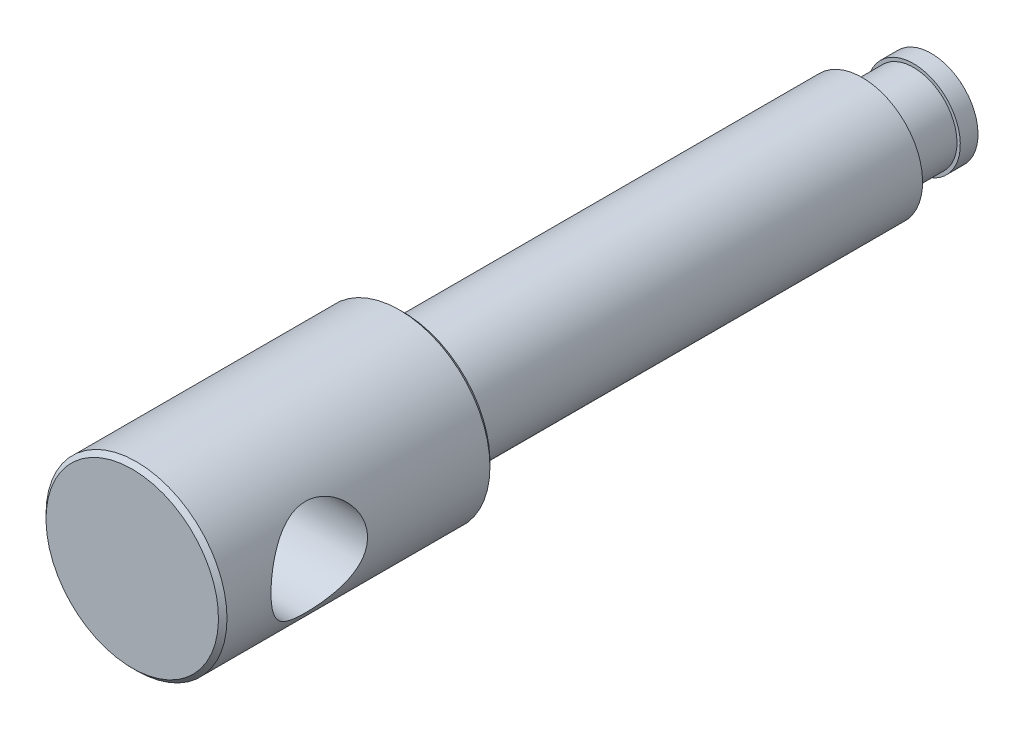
ISO-10303-21;
HEADER;
FILE_DESCRIPTION(('STEP AP214'),'2;1');
FILE_NAME('part.step','',(''),(''),'','','');
FILE_SCHEMA(('AUTOMOTIVE_DESIGN { 1 0 10303 214 1 1 1 1 }'));
ENDSEC;
DATA;
#1=APPLICATION_CONTEXT('core data for automotive mechanical design processes');
#2=APPLICATION_PROTOCOL_DEFINITION('international standard','automotive_design',2000,#1);
#3=PRODUCT_CONTEXT('',#1,'mechanical');
#4=PRODUCT('Part','Part','',(#3));
#5=PRODUCT_RELATED_PRODUCT_CATEGORY('part','',(#4));
#6=PRODUCT_DEFINITION_FORMATION('','',#4);
#7=PRODUCT_DEFINITION_CONTEXT('part definition',#1,'design');
#8=PRODUCT_DEFINITION('design','',#6,#7);
#9=PRODUCT_DEFINITION_SHAPE('','',#8);
#10=(LENGTH_UNIT() NAMED_UNIT(*) SI_UNIT(.MILLI.,.METRE.));
#11=(NAMED_UNIT(*) PLANE_ANGLE_UNIT() SI_UNIT($,.RADIAN.));
#12=(NAMED_UNIT(*) SI_UNIT($,.STERADIAN.) SOLID_ANGLE_UNIT());
#13=UNCERTAINTY_MEASURE_WITH_UNIT(LENGTH_MEASURE(1.E-05),#10,'distance_accuracy_value','');
#14=(GEOMETRIC_REPRESENTATION_CONTEXT(3) GLOBAL_UNCERTAINTY_ASSIGNED_CONTEXT((#13)) GLOBAL_UNIT_ASSIGNED_CONTEXT((#10,
#11,#12)) REPRESENTATION_CONTEXT('',''));
#15=CARTESIAN_POINT('',(0.,0.,0.));
#16=DIRECTION('',(0.,0.,1.));
#17=DIRECTION('',(1.,0.,0.));
#18=AXIS2_PLACEMENT_3D('',#15,#16,#17);
#19=CARTESIAN_POINT('',(0.,0.,13.));
#20=DIRECTION('',(-1.,0.,0.));
#21=DIRECTION('',(0.,1.,0.));
#22=AXIS2_PLACEMENT_3D('',#19,#20,#21);
#23=SPHERICAL_SURFACE('',#22,13.);
#24=CARTESIAN_POINT('',(0.,0.,2.56268712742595));
#25=DIRECTION('',(0.,0.,1.));
#26=DIRECTION('',(0.,-1.,0.));
#27=AXIS2_PLACEMENT_3D('',#24,#25,#26);
#28=CIRCLE('',#27,7.75);
#29=CARTESIAN_POINT('',(0.,-7.75,2.56268712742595));
#30=VERTEX_POINT('',#29);
#31=EDGE_CURVE('E130',#30,#30,#28,.T.);
#32=ORIENTED_EDGE('',*,*,#31,.F.);
#33=EDGE_LOOP('',(#32));
#34=FACE_BOUND('',#33,.T.);
#35=ADVANCED_FACE('F12',(#34),#23,.T.);
#36=CARTESIAN_POINT('',(0.,0.,135.));
#37=DIRECTION('',(0.,0.,-1.));
#38=DIRECTION('',(0.,1.,0.));
#39=AXIS2_PLACEMENT_3D('',#36,#37,#38);
#40=PLANE('',#39);
#41=CARTESIAN_POINT('',(0.,0.,135.));
#42=DIRECTION('',(0.,0.,-1.));
#43=DIRECTION('',(0.,1.,0.));
#44=AXIS2_PLACEMENT_3D('',#41,#42,#43);
#45=CIRCLE('',#44,14.2928932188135);
#46=CARTESIAN_POINT('',(0.,14.2928932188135,135.));
#47=VERTEX_POINT('',#46);
#48=EDGE_CURVE('E96',#47,#47,#45,.T.);
#49=ORIENTED_EDGE('',*,*,#48,.F.);
#50=EDGE_LOOP('',(#49));
#51=FACE_BOUND('',#50,.T.);
#52=ADVANCED_FACE('F103',(#51),#40,.F.);
#53=CARTESIAN_POINT('',(0.,0.,0.));
#54=DIRECTION('',(0.,0.,1.));
#55=DIRECTION('',(0.,-1.,0.));
#56=AXIS2_PLACEMENT_3D('',#53,#54,#55);
#57=CYLINDRICAL_SURFACE('',#56,7.75);
#58=CARTESIAN_POINT('',(0.,0.,5.5));
#59=DIRECTION('',(0.,0.,1.));
#60=DIRECTION('',(0.,-1.,0.));
#61=AXIS2_PLACEMENT_3D('',#58,#59,#60);
#62=CIRCLE('',#61,7.75);
#63=CARTESIAN_POINT('',(0.,-7.75,5.5));
#64=VERTEX_POINT('',#63);
#65=EDGE_CURVE('E133',#64,#64,#62,.F.);
#66=ORIENTED_EDGE('',*,*,#65,.T.);
#67=EDGE_LOOP('',(#66));
#68=FACE_BOUND('',#67,.T.);
#69=ORIENTED_EDGE('',*,*,#31,.T.);
#70=EDGE_LOOP('',(#69));
#71=FACE_BOUND('',#70,.T.);
#72=ADVANCED_FACE('F107',(#68,#71),#57,.T.);
#73=CARTESIAN_POINT('',(0.,0.,134.292893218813));
#74=DIRECTION('',(0.,0.,-1.));
#75=DIRECTION('',(0.,1.,0.));
#76=AXIS2_PLACEMENT_3D('',#73,#74,#75);
#77=CONICAL_SURFACE('',#76,15.0000000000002,0.785398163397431);
#78=ORIENTED_EDGE('',*,*,#48,.T.);
#79=EDGE_LOOP('',(#78));
#80=FACE_BOUND('',#79,.T.);
#81=CARTESIAN_POINT('',(0.,0.,134.292893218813));
#82=DIRECTION('',(0.,0.,1.));
#83=DIRECTION('',(0.,-1.,0.));
#84=AXIS2_PLACEMENT_3D('',#81,#82,#83);
#85=CIRCLE('',#84,15.);
#86=CARTESIAN_POINT('',(0.,-15.,134.292893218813));
#87=VERTEX_POINT('',#86);
#88=EDGE_CURVE('E93',#87,#87,#85,.F.);
#89=ORIENTED_EDGE('',*,*,#88,.F.);
#90=EDGE_LOOP('',(#89));
#91=FACE_BOUND('',#90,.T.);
#92=ADVANCED_FACE('F110',(#80,#91),#77,.T.);
#93=CARTESIAN_POINT('',(7.2,0.,5.5));
#94=DIRECTION('',(0.,0.,-1.));
#95=DIRECTION('',(0.,1.,0.));
#96=AXIS2_PLACEMENT_3D('',#93,#94,#95);
#97=PLANE('',#96);
#98=CARTESIAN_POINT('',(0.,0.,5.5));
#99=DIRECTION('',(0.,0.,1.));
#100=DIRECTION('',(0.,-1.,0.));
#101=AXIS2_PLACEMENT_3D('',#98,#99,#100);
#102=CIRCLE('',#101,7.2);
#103=CARTESIAN_POINT('',(0.,-7.2,5.5));
#104=VERTEX_POINT('',#103);
#105=EDGE_CURVE('E90',#104,#104,#102,.T.);
#106=ORIENTED_EDGE('',*,*,#105,.F.);
#107=EDGE_LOOP('',(#106));
#108=FACE_BOUND('',#107,.T.);
#109=ORIENTED_EDGE('',*,*,#65,.F.);
#110=EDGE_LOOP('',(#109));
#111=FACE_BOUND('',#110,.T.);
#112=ADVANCED_FACE('F44',(#108,#111),#97,.F.);
#113=CARTESIAN_POINT('',(0.,0.,0.));
#114=DIRECTION('',(0.,0.,1.));
#115=DIRECTION('',(0.,-1.,0.));
#116=AXIS2_PLACEMENT_3D('',#113,#114,#115);
#117=CYLINDRICAL_SURFACE('',#116,15.);
#118=CARTESIAN_POINT('',(-12.6885775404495,8.,119.));
#119=CARTESIAN_POINT('',(-12.6885765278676,8.00000082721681,118.793719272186));
#120=CARTESIAN_POINT('',(-12.6936244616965,7.99201174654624,118.587447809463));
#121=CARTESIAN_POINT('',(-12.7136132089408,7.96017537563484,118.176540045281));
#122=CARTESIAN_POINT('',(-12.728557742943,7.93632212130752,117.97190438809));
#123=CARTESIAN_POINT('',(-12.7677833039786,7.87306095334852,117.565697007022));
#124=CARTESIAN_POINT('',(-12.7920765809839,7.83363262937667,117.364129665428));
#125=CARTESIAN_POINT('',(-12.8491080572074,7.73973085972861,116.965672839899));
#126=CARTESIAN_POINT('',(-12.8818499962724,7.68525075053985,116.768785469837));
#127=CARTESIAN_POINT('',(-12.9544169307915,7.56228385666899,116.382225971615));
#128=CARTESIAN_POINT('',(-12.9941952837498,7.49388888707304,116.192515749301));
#129=CARTESIAN_POINT('',(-13.0797616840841,7.34352220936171,115.81989442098));
#130=CARTESIAN_POINT('',(-13.125551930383,7.26154553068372,115.636985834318));
#131=CARTESIAN_POINT('',(-13.2218490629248,7.08468954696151,115.278838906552));
#132=CARTESIAN_POINT('',(-13.2723552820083,6.98981206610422,115.103599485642));
#133=CARTESIAN_POINT('',(-13.3767912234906,6.78781438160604,114.761475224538));
#134=CARTESIAN_POINT('',(-13.4307210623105,6.68069376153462,114.594590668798));
#135=CARTESIAN_POINT('',(-13.6062056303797,6.32032913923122,114.076505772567));
#136=CARTESIAN_POINT('',(-13.7320055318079,6.04463813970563,113.741798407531));
#137=CARTESIAN_POINT('',(-13.9190407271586,5.59347847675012,113.276374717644));
#138=CARTESIAN_POINT('',(-13.98114670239,5.43671146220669,113.127257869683));
#139=CARTESIAN_POINT('',(-14.1034342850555,5.11109924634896,112.841794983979));
#140=CARTESIAN_POINT('',(-14.1636155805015,4.94225210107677,112.70545100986));
#141=CARTESIAN_POINT('',(-14.2852717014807,4.57935642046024,112.436116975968));
#142=CARTESIAN_POINT('',(-14.3464672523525,4.38437188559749,112.304260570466));
#143=CARTESIAN_POINT('',(-14.4632110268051,3.98237404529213,112.057647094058));
#144=CARTESIAN_POINT('',(-14.5187616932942,3.77536600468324,111.942882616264));
#145=CARTESIAN_POINT('',(-14.6226346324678,3.35057394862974,111.731581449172));
#146=CARTESIAN_POINT('',(-14.6709590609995,3.13279317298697,111.635039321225));
#147=CARTESIAN_POINT('',(-14.7589385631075,2.68795642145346,111.461307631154));
#148=CARTESIAN_POINT('',(-14.7985947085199,2.4609015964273,111.3841156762));
#149=CARTESIAN_POINT('',(-14.8652391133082,2.01763632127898,111.255446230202));
#150=CARTESIAN_POINT('',(-14.8929813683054,1.80198906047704,111.202417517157));
#151=CARTESIAN_POINT('',(-14.9392726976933,1.36607301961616,111.11436270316));
#152=CARTESIAN_POINT('',(-14.9578222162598,1.14580446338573,111.079335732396));
#153=CARTESIAN_POINT('',(-14.9851777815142,0.702641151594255,111.027796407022));
#154=CARTESIAN_POINT('',(-14.9939895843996,0.479748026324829,111.011273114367));
#155=CARTESIAN_POINT('',(-15.0016248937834,0.0331964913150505,110.996951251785));
#156=CARTESIAN_POINT('',(-15.0004491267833,-0.190461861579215,110.99915131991));
#157=CARTESIAN_POINT('',(-14.9887583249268,-0.61447105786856,111.021093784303));
#158=CARTESIAN_POINT('',(-14.9791774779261,-0.814941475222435,111.039081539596));
#159=CARTESIAN_POINT('',(-14.9521717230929,-1.21344088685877,111.090012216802));
#160=CARTESIAN_POINT('',(-14.9347467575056,-1.41146986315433,111.122955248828));
#161=CARTESIAN_POINT('',(-14.8924644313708,-1.80372417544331,111.203419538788));
#162=CARTESIAN_POINT('',(-14.8676071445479,-1.99794954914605,111.250940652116));
#163=CARTESIAN_POINT('',(-14.811029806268,-2.38137788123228,111.360053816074));
#164=CARTESIAN_POINT('',(-14.7793094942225,-2.57058064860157,111.421646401));
#165=CARTESIAN_POINT('',(-14.7092919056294,-2.94506910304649,111.559112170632));
#166=CARTESIAN_POINT('',(-14.6709217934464,-3.13028273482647,111.635144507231));
#167=CARTESIAN_POINT('',(-14.5886953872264,-3.49352300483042,111.800337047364));
#168=CARTESIAN_POINT('',(-14.5448372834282,-3.67154724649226,111.889501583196));
#169=CARTESIAN_POINT('',(-14.4063856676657,-4.19348838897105,112.175634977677));
#170=CARTESIAN_POINT('',(-14.3048709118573,-4.52549971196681,112.391327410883));
#171=CARTESIAN_POINT('',(-14.0802637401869,-5.18456327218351,112.891898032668));
#172=CARTESIAN_POINT('',(-13.9560254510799,-5.50754077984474,113.181628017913));
#173=CARTESIAN_POINT('',(-13.7688338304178,-5.95360340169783,113.651968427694));
#174=CARTESIAN_POINT('',(-13.7062463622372,-6.09599044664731,113.814853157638));
#175=CARTESIAN_POINT('',(-13.5822961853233,-6.36737369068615,114.151974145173));
#176=CARTESIAN_POINT('',(-13.5209336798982,-6.49636768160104,114.326212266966));
#177=CARTESIAN_POINT('',(-13.3962802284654,-6.74990405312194,114.699569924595));
#178=CARTESIAN_POINT('',(-13.3332248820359,-6.8732738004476,114.899565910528));
#179=CARTESIAN_POINT('',(-13.2125488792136,-7.10248719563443,115.310818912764));
#180=CARTESIAN_POINT('',(-13.154925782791,-7.20833872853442,115.522070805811));
#181=CARTESIAN_POINT('',(-13.0472441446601,-7.40146247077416,115.954608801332));
#182=CARTESIAN_POINT('',(-12.9971807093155,-7.48874671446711,116.175888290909));
#183=CARTESIAN_POINT('',(-12.9066564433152,-7.64370915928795,116.627114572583));
#184=CARTESIAN_POINT('',(-12.8661941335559,-7.71139038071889,116.857060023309));
#185=CARTESIAN_POINT('',(-12.7995566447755,-7.82145437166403,117.304826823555));
#186=CARTESIAN_POINT('',(-12.7724893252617,-7.86544291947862,117.522120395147));
#187=CARTESIAN_POINT('',(-12.7292029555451,-7.93530677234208,117.960676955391));
#188=CARTESIAN_POINT('',(-12.7129832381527,-7.96118319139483,118.181939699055));
#189=CARTESIAN_POINT('',(-12.6921440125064,-7.99436472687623,118.626216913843));
#190=CARTESIAN_POINT('',(-12.6875148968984,-8.00168522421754,118.849229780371));
#191=CARTESIAN_POINT('',(-12.6900500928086,-7.99766461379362,119.295008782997));
#192=CARTESIAN_POINT('',(-12.6972133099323,-7.9863252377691,119.517774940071));
#193=CARTESIAN_POINT('',(-12.7212695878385,-7.94793800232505,119.931405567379));
#194=CARTESIAN_POINT('',(-12.7367415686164,-7.92318043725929,120.122571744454));
#195=CARTESIAN_POINT('',(-12.7757602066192,-7.86010987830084,120.501879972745));
#196=CARTESIAN_POINT('',(-12.7993094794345,-7.82179249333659,120.690021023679));
#197=CARTESIAN_POINT('',(-12.8537208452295,-7.73205060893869,121.062040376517));
#198=CARTESIAN_POINT('',(-12.8845823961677,-7.68062708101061,121.245918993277));
#199=CARTESIAN_POINT('',(-12.9527088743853,-7.56517167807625,121.608524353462));
#200=CARTESIAN_POINT('',(-12.9899763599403,-7.50113476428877,121.787249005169));
#201=CARTESIAN_POINT('',(-13.0716388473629,-7.35794410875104,122.146370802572));
#202=CARTESIAN_POINT('',(-13.1162747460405,-7.27825059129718,122.326497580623));
#203=CARTESIAN_POINT('',(-13.2102058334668,-7.10633908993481,122.679469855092));
#204=CARTESIAN_POINT('',(-13.2595025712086,-7.01411693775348,122.852312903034));
#205=CARTESIAN_POINT('',(-13.3615387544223,-6.81773611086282,123.19006493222));
#206=CARTESIAN_POINT('',(-13.4142789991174,-6.71357466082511,123.354972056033));
#207=CARTESIAN_POINT('',(-13.5220005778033,-6.49387939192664,123.676260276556));
#208=CARTESIAN_POINT('',(-13.5769820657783,-6.37834479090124,123.832640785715));
#209=CARTESIAN_POINT('',(-13.6962134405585,-6.11858240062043,124.158736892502));
#210=CARTESIAN_POINT('',(-13.7606355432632,-5.97263494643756,124.327023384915));
#211=CARTESIAN_POINT('',(-13.8892269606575,-5.66717190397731,124.650904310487));
#212=CARTESIAN_POINT('',(-13.9533962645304,-5.50765574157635,124.806498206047));
#213=CARTESIAN_POINT('',(-14.0799012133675,-5.17570667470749,125.104243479));
#214=CARTESIAN_POINT('',(-14.1422360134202,-5.00326794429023,125.246388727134));
#215=CARTESIAN_POINT('',(-14.2634999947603,-4.64630001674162,125.516284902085));
#216=CARTESIAN_POINT('',(-14.3224287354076,-4.46176926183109,125.644033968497));
#217=CARTESIAN_POINT('',(-14.4377604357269,-4.0735448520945,125.889202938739));
#218=CARTESIAN_POINT('',(-14.4939538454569,-3.86937210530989,126.005965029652));
#219=CARTESIAN_POINT('',(-14.5994119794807,-3.45019516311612,126.221611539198));
#220=CARTESIAN_POINT('',(-14.6486799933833,-3.23519617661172,126.320504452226));
#221=CARTESIAN_POINT('',(-14.7388392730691,-2.79586603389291,126.499289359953));
#222=CARTESIAN_POINT('',(-14.7797350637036,-2.57153999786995,126.579191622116));
#223=CARTESIAN_POINT('',(-14.8519055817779,-2.11523636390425,126.718982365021));
#224=CARTESIAN_POINT('',(-14.8831816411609,-1.88325983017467,126.778873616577));
#225=CARTESIAN_POINT('',(-14.9325301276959,-1.43696201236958,126.872857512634));
#226=CARTESIAN_POINT('',(-14.9516024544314,-1.22316354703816,126.908915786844));
#227=CARTESIAN_POINT('',(-14.980590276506,-0.792732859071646,126.963581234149));
#228=CARTESIAN_POINT('',(-14.9905063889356,-0.576100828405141,126.982189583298));
#229=CARTESIAN_POINT('',(-15.0009003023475,-0.141899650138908,127.001692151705));
#230=CARTESIAN_POINT('',(-15.0013817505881,0.0756691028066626,127.002593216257));
#231=CARTESIAN_POINT('',(-14.9929015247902,0.509967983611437,126.986685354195));
#232=CARTESIAN_POINT('',(-14.9839402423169,0.726698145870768,126.969877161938));
#233=CARTESIAN_POINT('',(-14.9579364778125,1.13993624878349,126.920874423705));
#234=CARTESIAN_POINT('',(-14.9416116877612,1.33665343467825,126.890044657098));
#235=CARTESIAN_POINT('',(-14.9015877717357,1.72658766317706,126.813985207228));
#236=CARTESIAN_POINT('',(-14.8778861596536,1.91980350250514,126.768750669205));
#237=CARTESIAN_POINT('',(-14.8236550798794,2.30138685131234,126.664380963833));
#238=CARTESIAN_POINT('',(-14.7931277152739,2.48975583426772,126.605250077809));
#239=CARTESIAN_POINT('',(-14.7258931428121,2.86070279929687,126.473628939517));
#240=CARTESIAN_POINT('',(-14.6891835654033,3.04327852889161,126.401133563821));
#241=CARTESIAN_POINT('',(-14.6088870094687,3.40831874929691,126.240483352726));
#242=CARTESIAN_POINT('',(-14.5650946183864,3.59052521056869,126.151845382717));
#243=CARTESIAN_POINT('',(-14.4726171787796,3.94680147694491,125.961577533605));
#244=CARTESIAN_POINT('',(-14.4239303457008,4.12086828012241,125.859942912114));
#245=CARTESIAN_POINT('',(-14.3226773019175,4.46007274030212,125.644406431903));
#246=CARTESIAN_POINT('',(-14.27011056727,4.62520918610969,125.530502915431));
#247=CARTESIAN_POINT('',(-14.1621589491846,4.94589577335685,125.291117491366));
#248=CARTESIAN_POINT('',(-14.1067738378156,5.10144513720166,125.165634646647));
#249=CARTESIAN_POINT('',(-13.9880757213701,5.41899884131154,124.889270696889));
#250=CARTESIAN_POINT('',(-13.9245623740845,5.57982089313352,124.737114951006));
#251=CARTESIAN_POINT('',(-13.7969814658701,5.88822197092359,124.420124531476));
#252=CARTESIAN_POINT('',(-13.7329138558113,6.03579980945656,124.25528872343));
#253=CARTESIAN_POINT('',(-13.6057891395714,6.31714795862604,123.913520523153));
#254=CARTESIAN_POINT('',(-13.5427332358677,6.4509027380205,123.736574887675));
#255=CARTESIAN_POINT('',(-13.4194175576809,6.70365634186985,123.371530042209));
#256=CARTESIAN_POINT('',(-13.3591576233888,6.82265601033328,123.18343147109));
#257=CARTESIAN_POINT('',(-13.2400605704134,7.05111918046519,122.786418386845));
#258=CARTESIAN_POINT('',(-13.1814769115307,7.15971815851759,122.576928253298));
#259=CARTESIAN_POINT('',(-13.0714949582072,7.35859675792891,122.14754436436));
#260=CARTESIAN_POINT('',(-13.0200978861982,7.44887326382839,121.927648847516));
#261=CARTESIAN_POINT('',(-12.926727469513,7.60975396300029,121.47954511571));
#262=CARTESIAN_POINT('',(-12.8847276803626,7.68041349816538,121.251362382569));
#263=CARTESIAN_POINT('',(-12.8119002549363,7.80129547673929,120.788029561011));
#264=CARTESIAN_POINT('',(-12.7810652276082,7.85153144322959,120.552884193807));
#265=CARTESIAN_POINT('',(-12.7342469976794,7.92721566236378,120.098831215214));
#266=CARTESIAN_POINT('',(-12.7171886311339,7.95446803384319,119.880334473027));
#267=CARTESIAN_POINT('',(-12.6943542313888,7.99086010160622,119.441221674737));
#268=CARTESIAN_POINT('',(-12.6885786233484,7.99999911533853,119.220605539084));
#269=CARTESIAN_POINT('',(-12.6885775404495,8.,119.));
#270=B_SPLINE_CURVE_WITH_KNOTS('',3,(#118,#119,#120,#121,#122,#123,#124,#125,#126,#127,#128,
#129,#130,#131,#132,#133,#134,#135,#136,#137,#138,#139,#140,#141,#142,#143,#144,#145,#146,#147,
#148,#149,#150,#151,#152,#153,#154,#155,#156,#157,#158,#159,#160,#161,#162,#163,#164,#165,#166,
#167,#168,#169,#170,#171,#172,#173,#174,#175,#176,#177,#178,#179,#180,#181,#182,#183,#184,#185,
#186,#187,#188,#189,#190,#191,#192,#193,#194,#195,#196,#197,#198,#199,#200,#201,#202,#203,#204,
#205,#206,#207,#208,#209,#210,#211,#212,#213,#214,#215,#216,#217,#218,#219,#220,#221,#222,#223,
#224,#225,#226,#227,#228,#229,#230,#231,#232,#233,#234,#235,#236,#237,#238,#239,#240,#241,#242,
#243,#244,#245,#246,#247,#248,#249,#250,#251,#252,#253,#254,#255,#256,#257,#258,#259,#260,#261,
#262,#263,#264,#265,#266,#267,#268,#269),.UNSPECIFIED.,.T.,.F.,(4,2,2,2,2,2,2,2,2,2,2,2,2,2,2,2,
2,2,2,2,2,2,2,2,2,2,2,2,2,2,2,2,2,2,2,2,2,2,2,2,2,2,2,2,2,2,2,2,2,2,2,2,2,2,2,2,2,2,2,2,2,2,2,2,
2,2,2,2,2,2,2,2,2,2,2,4),(0.,0.618612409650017,1.23745751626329,1.85711629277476,
2.47704983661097,3.09301829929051,3.7092126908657,4.32532004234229,4.94144835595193,
6.28932977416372,6.96411577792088,7.63901061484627,8.36770205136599,9.09607678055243,
9.8242337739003,10.5523006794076,11.2227676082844,11.893202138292,12.5632401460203,
13.2332294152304,13.8370243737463,14.4408237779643,15.0446171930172,15.6484335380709,
16.2593380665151,16.8704445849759,18.0919304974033,19.4399210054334,20.1150149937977,
20.7902201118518,21.5191974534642,22.247845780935,22.9760203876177,23.7040827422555,
24.3731385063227,25.0421531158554,25.7106130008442,26.3790108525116,26.9584945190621,
27.5381660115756,28.1177945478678,28.6976551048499,29.3029446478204,29.9084360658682,
30.5140685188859,31.1197426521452,31.8146386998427,32.5095641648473,33.2048048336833,
33.900135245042,34.6246245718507,35.3487685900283,36.0725201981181,36.796171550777,
37.4482560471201,38.1002965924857,38.7520850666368,39.4038465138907,40.0025200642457,
40.6013955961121,41.2000868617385,41.7990081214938,42.4202632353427,43.041745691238,
43.6633122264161,44.2849291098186,44.9751514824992,45.665435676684,46.356487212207,
47.0474992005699,47.7759050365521,48.5044346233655,49.2308875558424,49.9568586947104,
50.6184046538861,51.2799755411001),.UNSPECIFIED.);
#271=CARTESIAN_POINT('',(-12.6885775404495,8.,119.));
#272=VERTEX_POINT('',#271);
#273=EDGE_CURVE('E24',#272,#272,#270,.T.);
#274=ORIENTED_EDGE('',*,*,#273,.F.);
#275=EDGE_LOOP('',(#274));
#276=FACE_BOUND('',#275,.T.);
#277=ORIENTED_EDGE('',*,*,#88,.T.);
#278=EDGE_LOOP('',(#277));
#279=FACE_BOUND('',#278,.T.);
#280=CARTESIAN_POINT('',(12.6885775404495,8.,119.));
#281=CARTESIAN_POINT('',(12.6885765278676,8.00000082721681,119.206280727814));
#282=CARTESIAN_POINT('',(12.6936244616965,7.99201174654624,119.412552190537));
#283=CARTESIAN_POINT('',(12.7136132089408,7.96017537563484,119.823459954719));
#284=CARTESIAN_POINT('',(12.728557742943,7.93632212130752,120.02809561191));
#285=CARTESIAN_POINT('',(12.7677833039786,7.87306095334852,120.434302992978));
#286=CARTESIAN_POINT('',(12.7920765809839,7.83363262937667,120.635870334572));
#287=CARTESIAN_POINT('',(12.8491080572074,7.73973085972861,121.034327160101));
#288=CARTESIAN_POINT('',(12.8818499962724,7.68525075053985,121.231214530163));
#289=CARTESIAN_POINT('',(12.9544169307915,7.56228385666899,121.617774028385));
#290=CARTESIAN_POINT('',(12.9941952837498,7.49388888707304,121.807484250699));
#291=CARTESIAN_POINT('',(13.0797616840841,7.34352220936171,122.18010557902));
#292=CARTESIAN_POINT('',(13.125551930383,7.26154553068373,122.363014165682));
#293=CARTESIAN_POINT('',(13.2218490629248,7.08468954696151,122.721161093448));
#294=CARTESIAN_POINT('',(13.2723552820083,6.98981206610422,122.896400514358));
#295=CARTESIAN_POINT('',(13.3767912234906,6.78781438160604,123.238524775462));
#296=CARTESIAN_POINT('',(13.4307210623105,6.68069376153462,123.405409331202));
#297=CARTESIAN_POINT('',(13.6062056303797,6.32032913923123,123.923494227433));
#298=CARTESIAN_POINT('',(13.7320055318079,6.04463813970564,124.258201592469));
#299=CARTESIAN_POINT('',(13.9190407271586,5.59347847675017,124.723625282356));
#300=CARTESIAN_POINT('',(13.98114670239,5.43671146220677,124.872742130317));
#301=CARTESIAN_POINT('',(14.1034342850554,5.11109924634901,125.158205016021));
#302=CARTESIAN_POINT('',(14.1636155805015,4.94225210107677,125.29454899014));
#303=CARTESIAN_POINT('',(14.2852717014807,4.57935642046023,125.563883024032));
#304=CARTESIAN_POINT('',(14.3464672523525,4.38437188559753,125.695739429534));
#305=CARTESIAN_POINT('',(14.463211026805,3.9823740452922,125.942352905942));
#306=CARTESIAN_POINT('',(14.5187616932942,3.77536600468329,126.057117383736));
#307=CARTESIAN_POINT('',(14.6226346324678,3.35057394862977,126.268418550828));
#308=CARTESIAN_POINT('',(14.6709590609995,3.13279317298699,126.364960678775));
#309=CARTESIAN_POINT('',(14.7589385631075,2.68795642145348,126.538692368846));
#310=CARTESIAN_POINT('',(14.7985947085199,2.46090159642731,126.6158843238));
#311=CARTESIAN_POINT('',(14.8652391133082,2.01763632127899,126.744553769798));
#312=CARTESIAN_POINT('',(14.8929813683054,1.80198906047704,126.797582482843));
#313=CARTESIAN_POINT('',(14.9392726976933,1.36607301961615,126.88563729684));
#314=CARTESIAN_POINT('',(14.9578222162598,1.14580446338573,126.920664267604));
#315=CARTESIAN_POINT('',(14.9851777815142,0.702641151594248,126.972203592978));
#316=CARTESIAN_POINT('',(14.9939895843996,0.479748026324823,126.988726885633));
#317=CARTESIAN_POINT('',(15.0016248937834,0.033196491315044,127.003048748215));
#318=CARTESIAN_POINT('',(15.0004491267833,-0.19046186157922,127.00084868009));
#319=CARTESIAN_POINT('',(14.9887583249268,-0.614471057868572,126.978906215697));
#320=CARTESIAN_POINT('',(14.9791774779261,-0.814941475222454,126.960918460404));
#321=CARTESIAN_POINT('',(14.9521717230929,-1.2134408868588,126.909987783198));
#322=CARTESIAN_POINT('',(14.9347467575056,-1.41146986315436,126.877044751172));
#323=CARTESIAN_POINT('',(14.8924644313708,-1.80372417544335,126.796580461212));
#324=CARTESIAN_POINT('',(14.8676071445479,-1.9979495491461,126.749059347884));
#325=CARTESIAN_POINT('',(14.811029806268,-2.38137788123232,126.639946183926));
#326=CARTESIAN_POINT('',(14.7793094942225,-2.57058064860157,126.578353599));
#327=CARTESIAN_POINT('',(14.7092919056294,-2.9450691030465,126.440887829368));
#328=CARTESIAN_POINT('',(14.6709217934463,-3.13028273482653,126.364855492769));
#329=CARTESIAN_POINT('',(14.5886953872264,-3.4935230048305,126.199662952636));
#330=CARTESIAN_POINT('',(14.5448372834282,-3.67154724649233,126.110498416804));
#331=CARTESIAN_POINT('',(14.4063856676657,-4.19348838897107,125.824365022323));
#332=CARTESIAN_POINT('',(14.3048709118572,-4.52549971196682,125.608672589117));
#333=CARTESIAN_POINT('',(14.0802637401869,-5.1845632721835,125.108101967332));
#334=CARTESIAN_POINT('',(13.9560254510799,-5.50754077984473,124.818371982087));
#335=CARTESIAN_POINT('',(13.7688338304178,-5.95360340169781,124.348031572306));
#336=CARTESIAN_POINT('',(13.7062463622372,-6.0959904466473,124.185146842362));
#337=CARTESIAN_POINT('',(13.5822961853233,-6.36737369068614,123.848025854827));
#338=CARTESIAN_POINT('',(13.5209336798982,-6.49636768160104,123.673787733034));
#339=CARTESIAN_POINT('',(13.3962802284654,-6.74990405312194,123.300430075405));
#340=CARTESIAN_POINT('',(13.3332248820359,-6.8732738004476,123.100434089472));
#341=CARTESIAN_POINT('',(13.2125488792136,-7.10248719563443,122.689181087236));
#342=CARTESIAN_POINT('',(13.154925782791,-7.20833872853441,122.477929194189));
#343=CARTESIAN_POINT('',(13.0472441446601,-7.40146247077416,122.045391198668));
#344=CARTESIAN_POINT('',(12.9971807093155,-7.4887467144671,121.824111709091));
#345=CARTESIAN_POINT('',(12.9066564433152,-7.64370915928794,121.372885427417));
#346=CARTESIAN_POINT('',(12.8661941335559,-7.71139038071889,121.142939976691));
#347=CARTESIAN_POINT('',(12.7995566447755,-7.82145437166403,120.695173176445));
#348=CARTESIAN_POINT('',(12.7724893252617,-7.86544291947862,120.477879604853));
#349=CARTESIAN_POINT('',(12.7292029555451,-7.93530677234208,120.039323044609));
#350=CARTESIAN_POINT('',(12.7129832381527,-7.96118319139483,119.818060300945));
#351=CARTESIAN_POINT('',(12.6921440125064,-7.99436472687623,119.373783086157));
#352=CARTESIAN_POINT('',(12.6875148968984,-8.00168522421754,119.150770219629));
#353=CARTESIAN_POINT('',(12.6900500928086,-7.99766461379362,118.704991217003));
#354=CARTESIAN_POINT('',(12.6972133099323,-7.9863252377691,118.482225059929));
#355=CARTESIAN_POINT('',(12.7212695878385,-7.94793800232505,118.068594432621));
#356=CARTESIAN_POINT('',(12.7367415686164,-7.92318043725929,117.877428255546));
#357=CARTESIAN_POINT('',(12.7757602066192,-7.86010987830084,117.498120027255));
#358=CARTESIAN_POINT('',(12.7993094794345,-7.82179249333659,117.309978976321));
#359=CARTESIAN_POINT('',(12.8537208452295,-7.73205060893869,116.937959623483));
#360=CARTESIAN_POINT('',(12.8845823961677,-7.68062708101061,116.754081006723));
#361=CARTESIAN_POINT('',(12.9527088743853,-7.56517167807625,116.391475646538));
#362=CARTESIAN_POINT('',(12.9899763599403,-7.50113476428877,116.212750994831));
#363=CARTESIAN_POINT('',(13.0716388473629,-7.35794410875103,115.853629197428));
#364=CARTESIAN_POINT('',(13.1162747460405,-7.27825059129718,115.673502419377));
#365=CARTESIAN_POINT('',(13.2102058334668,-7.10633908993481,115.320530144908));
#366=CARTESIAN_POINT('',(13.2595025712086,-7.01411693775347,115.147687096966));
#367=CARTESIAN_POINT('',(13.3615387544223,-6.81773611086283,114.80993506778));
#368=CARTESIAN_POINT('',(13.4142789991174,-6.71357466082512,114.645027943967));
#369=CARTESIAN_POINT('',(13.5220005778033,-6.49387939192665,114.323739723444));
#370=CARTESIAN_POINT('',(13.5769820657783,-6.37834479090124,114.167359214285));
#371=CARTESIAN_POINT('',(13.6962134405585,-6.11858240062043,113.841263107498));
#372=CARTESIAN_POINT('',(13.7606355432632,-5.97263494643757,113.672976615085));
#373=CARTESIAN_POINT('',(13.8892269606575,-5.66717190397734,113.349095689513));
#374=CARTESIAN_POINT('',(13.9533962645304,-5.50765574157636,113.193501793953));
#375=CARTESIAN_POINT('',(14.0799012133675,-5.17570667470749,112.895756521));
#376=CARTESIAN_POINT('',(14.1422360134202,-5.00326794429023,112.753611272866));
#377=CARTESIAN_POINT('',(14.2634999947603,-4.64630001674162,112.483715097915));
#378=CARTESIAN_POINT('',(14.3224287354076,-4.46176926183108,112.355966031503));
#379=CARTESIAN_POINT('',(14.4377604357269,-4.07354485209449,112.110797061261));
#380=CARTESIAN_POINT('',(14.4939538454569,-3.86937210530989,111.994034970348));
#381=CARTESIAN_POINT('',(14.5994119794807,-3.45019516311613,111.778388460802));
#382=CARTESIAN_POINT('',(14.6486799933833,-3.23519617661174,111.679495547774));
#383=CARTESIAN_POINT('',(14.7388392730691,-2.79586603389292,111.500710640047));
#384=CARTESIAN_POINT('',(14.7797350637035,-2.57153999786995,111.420808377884));
#385=CARTESIAN_POINT('',(14.8519055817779,-2.11523636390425,111.281017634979));
#386=CARTESIAN_POINT('',(14.8831816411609,-1.88325983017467,111.221126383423));
#387=CARTESIAN_POINT('',(14.9325301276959,-1.43696201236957,111.127142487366));
#388=CARTESIAN_POINT('',(14.9516024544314,-1.22316354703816,111.091084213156));
#389=CARTESIAN_POINT('',(14.980590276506,-0.792732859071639,111.036418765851));
#390=CARTESIAN_POINT('',(14.9905063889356,-0.576100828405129,111.017810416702));
#391=CARTESIAN_POINT('',(15.0009003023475,-0.141899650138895,110.998307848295));
#392=CARTESIAN_POINT('',(15.0013817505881,0.0756691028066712,110.997406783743));
#393=CARTESIAN_POINT('',(14.9929015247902,0.509967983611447,111.013314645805));
#394=CARTESIAN_POINT('',(14.9839402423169,0.726698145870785,111.030122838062));
#395=CARTESIAN_POINT('',(14.9579364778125,1.13993624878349,111.079125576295));
#396=CARTESIAN_POINT('',(14.9416116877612,1.33665343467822,111.109955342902));
#397=CARTESIAN_POINT('',(14.9015877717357,1.72658766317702,111.186014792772));
#398=CARTESIAN_POINT('',(14.8778861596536,1.91980350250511,111.231249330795));
#399=CARTESIAN_POINT('',(14.8236550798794,2.30138685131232,111.335619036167));
#400=CARTESIAN_POINT('',(14.7931277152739,2.4897558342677,111.394749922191));
#401=CARTESIAN_POINT('',(14.7258931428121,2.86070279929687,111.526371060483));
#402=CARTESIAN_POINT('',(14.6891835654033,3.04327852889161,111.598866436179));
#403=CARTESIAN_POINT('',(14.6088870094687,3.40831874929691,111.759516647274));
#404=CARTESIAN_POINT('',(14.5650946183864,3.59052521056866,111.848154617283));
#405=CARTESIAN_POINT('',(14.4726171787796,3.94680147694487,112.038422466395));
#406=CARTESIAN_POINT('',(14.4239303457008,4.12086828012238,112.140057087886));
#407=CARTESIAN_POINT('',(14.3226773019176,4.46007274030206,112.355593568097));
#408=CARTESIAN_POINT('',(14.27011056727,4.62520918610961,112.469497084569));
#409=CARTESIAN_POINT('',(14.1621589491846,4.9458957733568,112.708882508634));
#410=CARTESIAN_POINT('',(14.1067738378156,5.10144513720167,112.834365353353));
#411=CARTESIAN_POINT('',(13.9880757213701,5.41899884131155,113.110729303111));
#412=CARTESIAN_POINT('',(13.9245623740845,5.57982089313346,113.262885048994));
#413=CARTESIAN_POINT('',(13.7969814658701,5.8882219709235,113.579875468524));
#414=CARTESIAN_POINT('',(13.7329138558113,6.0357998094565,113.74471127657));
#415=CARTESIAN_POINT('',(13.6057891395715,6.317147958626,114.086479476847));
#416=CARTESIAN_POINT('',(13.5427332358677,6.45090273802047,114.263425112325));
#417=CARTESIAN_POINT('',(13.4194175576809,6.70365634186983,114.628469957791));
#418=CARTESIAN_POINT('',(13.3591576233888,6.82265601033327,114.81656852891));
#419=CARTESIAN_POINT('',(13.2400605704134,7.0511191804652,115.213581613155));
#420=CARTESIAN_POINT('',(13.1814769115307,7.1597181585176,115.423071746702));
#421=CARTESIAN_POINT('',(13.0714949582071,7.35859675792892,115.85245563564));
#422=CARTESIAN_POINT('',(13.0200978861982,7.4488732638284,116.072351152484));
#423=CARTESIAN_POINT('',(12.926727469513,7.60975396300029,116.52045488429));
#424=CARTESIAN_POINT('',(12.8847276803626,7.68041349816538,116.748637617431));
#425=CARTESIAN_POINT('',(12.8119002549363,7.80129547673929,117.211970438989));
#426=CARTESIAN_POINT('',(12.7810652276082,7.85153144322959,117.447115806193));
#427=CARTESIAN_POINT('',(12.7342469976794,7.92721566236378,117.901168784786));
#428=CARTESIAN_POINT('',(12.7171886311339,7.95446803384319,118.119665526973));
#429=CARTESIAN_POINT('',(12.6943542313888,7.99086010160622,118.558778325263));
#430=CARTESIAN_POINT('',(12.6885786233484,7.99999911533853,118.779394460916));
#431=CARTESIAN_POINT('',(12.6885775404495,8.,119.));
#432=B_SPLINE_CURVE_WITH_KNOTS('',3,(#280,#281,#282,#283,#284,#285,#286,#287,#288,#289,#290,
#291,#292,#293,#294,#295,#296,#297,#298,#299,#300,#301,#302,#303,#304,#305,#306,#307,#308,#309,
#310,#311,#312,#313,#314,#315,#316,#317,#318,#319,#320,#321,#322,#323,#324,#325,#326,#327,#328,
#329,#330,#331,#332,#333,#334,#335,#336,#337,#338,#339,#340,#341,#342,#343,#344,#345,#346,#347,
#348,#349,#350,#351,#352,#353,#354,#355,#356,#357,#358,#359,#360,#361,#362,#363,#364,#365,#366,
#367,#368,#369,#370,#371,#372,#373,#374,#375,#376,#377,#378,#379,#380,#381,#382,#383,#384,#385,
#386,#387,#388,#389,#390,#391,#392,#393,#394,#395,#396,#397,#398,#399,#400,#401,#402,#403,#404,
#405,#406,#407,#408,#409,#410,#411,#412,#413,#414,#415,#416,#417,#418,#419,#420,#421,#422,#423,
#424,#425,#426,#427,#428,#429,#430,#431),.UNSPECIFIED.,.T.,.F.,(4,2,2,2,2,2,2,2,2,2,2,2,2,2,2,2,
2,2,2,2,2,2,2,2,2,2,2,2,2,2,2,2,2,2,2,2,2,2,2,2,2,2,2,2,2,2,2,2,2,2,2,2,2,2,2,2,2,2,2,2,2,2,2,2,
2,2,2,2,2,2,2,2,2,2,2,4),(0.,0.618612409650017,1.23745751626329,1.85711629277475,
2.47704983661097,3.09301829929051,3.7092126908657,4.3253200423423,4.94144835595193,
6.28932977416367,6.96411577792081,7.63901061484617,8.36770205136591,9.09607678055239,
9.82423377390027,10.5523006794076,11.2227676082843,11.893202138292,12.5632401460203,
13.2332294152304,13.8370243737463,14.4408237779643,15.0446171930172,15.6484335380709,
16.2593380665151,16.8704445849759,18.0919304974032,19.4399210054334,20.1150149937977,
20.7902201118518,21.5191974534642,22.247845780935,22.9760203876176,23.7040827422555,
24.3731385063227,25.0421531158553,25.7106130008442,26.3790108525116,26.9584945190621,
27.5381660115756,28.1177945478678,28.6976551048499,29.3029446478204,29.9084360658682,
30.5140685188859,31.1197426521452,31.8146386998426,32.5095641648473,33.2048048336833,
33.900135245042,34.6246245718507,35.3487685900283,36.0725201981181,36.796171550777,
37.4482560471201,38.1002965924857,38.7520850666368,39.4038465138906,40.0025200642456,
40.6013955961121,41.2000868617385,41.7990081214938,42.4202632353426,43.041745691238,
43.663312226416,44.2849291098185,44.9751514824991,45.665435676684,46.3564872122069,
47.0474992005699,47.7759050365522,48.5044346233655,49.2308875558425,49.9568586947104,
50.6184046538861,51.2799755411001),.UNSPECIFIED.);
#433=CARTESIAN_POINT('',(12.6885775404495,8.,119.));
#434=VERTEX_POINT('',#433);
#435=EDGE_CURVE('E8',#434,#434,#432,.T.);
#436=ORIENTED_EDGE('',*,*,#435,.F.);
#437=EDGE_LOOP('',(#436));
#438=FACE_BOUND('',#437,.T.);
#439=CARTESIAN_POINT('',(0.,0.,90.7071067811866));
#440=DIRECTION('',(0.,0.,1.));
#441=DIRECTION('',(0.,-1.,0.));
#442=AXIS2_PLACEMENT_3D('',#439,#440,#441);
#443=CIRCLE('',#442,15.);
#444=CARTESIAN_POINT('',(0.,-15.,90.7071067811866));
#445=VERTEX_POINT('',#444);
#446=EDGE_CURVE('E82',#445,#445,#443,.F.);
#447=ORIENTED_EDGE('',*,*,#446,.F.);
#448=EDGE_LOOP('',(#447));
#449=FACE_BOUND('',#448,.T.);
#450=ADVANCED_FACE('F38',(#276,#279,#438,#449),#117,.T.);
#451=CARTESIAN_POINT('',(0.,0.,0.));
#452=DIRECTION('',(0.,0.,1.));
#453=DIRECTION('',(0.,-1.,0.));
#454=AXIS2_PLACEMENT_3D('',#451,#452,#453);
#455=CYLINDRICAL_SURFACE('',#454,7.2);
#456=CARTESIAN_POINT('',(0.,0.,12.383419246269));
#457=DIRECTION('',(0.,0.,1.));
#458=DIRECTION('',(0.,-1.,0.));
#459=AXIS2_PLACEMENT_3D('',#456,#457,#458);
#460=CIRCLE('',#459,7.2);
#461=CARTESIAN_POINT('',(0.,-7.2,12.383419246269));
#462=VERTEX_POINT('',#461);
#463=EDGE_CURVE('E77',#462,#462,#460,.T.);
#464=ORIENTED_EDGE('',*,*,#463,.F.);
#465=EDGE_LOOP('',(#464));
#466=FACE_BOUND('',#465,.T.);
#467=ORIENTED_EDGE('',*,*,#105,.T.);
#468=EDGE_LOOP('',(#467));
#469=FACE_BOUND('',#468,.T.);
#470=ADVANCED_FACE('F43',(#466,#469),#455,.T.);
#471=CARTESIAN_POINT('',(0.,0.,90.7071067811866));
#472=DIRECTION('',(0.,0.,1.));
#473=DIRECTION('',(0.,-1.,0.));
#474=AXIS2_PLACEMENT_3D('',#471,#472,#473);
#475=CONICAL_SURFACE('',#474,15.,0.78539816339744);
#476=ORIENTED_EDGE('',*,*,#446,.T.);
#477=EDGE_LOOP('',(#476));
#478=FACE_BOUND('',#477,.T.);
#479=CARTESIAN_POINT('',(0.,0.,90.));
#480=DIRECTION('',(0.,0.,1.));
#481=DIRECTION('',(0.,-1.,0.));
#482=AXIS2_PLACEMENT_3D('',#479,#480,#481);
#483=CIRCLE('',#482,14.2928932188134);
#484=CARTESIAN_POINT('',(0.,-14.2928932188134,90.));
#485=VERTEX_POINT('',#484);
#486=EDGE_CURVE('E78',#485,#485,#483,.T.);
#487=ORIENTED_EDGE('',*,*,#486,.T.);
#488=EDGE_LOOP('',(#487));
#489=FACE_BOUND('',#488,.T.);
#490=ADVANCED_FACE('F50',(#478,#489),#475,.T.);
#491=CARTESIAN_POINT('',(0.,0.,14.));
#492=DIRECTION('',(0.,0.,1.));
#493=DIRECTION('',(-1.,0.,0.));
#494=AXIS2_PLACEMENT_3D('',#491,#492,#493);
#495=CONICAL_SURFACE('',#494,10.,1.0471975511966);
#496=CARTESIAN_POINT('',(0.,0.,14.));
#497=DIRECTION('',(0.,0.,1.));
#498=DIRECTION('',(0.,-1.,0.));
#499=AXIS2_PLACEMENT_3D('',#496,#497,#498);
#500=CIRCLE('',#499,10.);
#501=CARTESIAN_POINT('',(0.,-10.,14.));
#502=VERTEX_POINT('',#501);
#503=EDGE_CURVE('E28',#502,#502,#500,.T.);
#504=ORIENTED_EDGE('',*,*,#503,.F.);
#505=EDGE_LOOP('',(#504));
#506=FACE_BOUND('',#505,.T.);
#507=ORIENTED_EDGE('',*,*,#463,.T.);
#508=EDGE_LOOP('',(#507));
#509=FACE_BOUND('',#508,.T.);
#510=ADVANCED_FACE('F54',(#506,#509),#495,.T.);
#511=CARTESIAN_POINT('',(14.2928932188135,0.,90.));
#512=DIRECTION('',(0.,0.,1.));
#513=DIRECTION('',(0.,-1.,0.));
#514=AXIS2_PLACEMENT_3D('',#511,#512,#513);
#515=PLANE('',#514);
#516=ORIENTED_EDGE('',*,*,#486,.F.);
#517=EDGE_LOOP('',(#516));
#518=FACE_BOUND('',#517,.T.);
#519=CARTESIAN_POINT('',(0.,0.,90.));
#520=DIRECTION('',(0.,0.,1.));
#521=DIRECTION('',(0.,-1.,0.));
#522=AXIS2_PLACEMENT_3D('',#519,#520,#521);
#523=CIRCLE('',#522,10.);
#524=CARTESIAN_POINT('',(0.,-10.,90.));
#525=VERTEX_POINT('',#524);
#526=EDGE_CURVE('E32',#525,#525,#523,.F.);
#527=ORIENTED_EDGE('',*,*,#526,.F.);
#528=EDGE_LOOP('',(#527));
#529=FACE_BOUND('',#528,.T.);
#530=ADVANCED_FACE('F58',(#518,#529),#515,.F.);
#531=CARTESIAN_POINT('',(0.,0.,0.));
#532=DIRECTION('',(0.,0.,1.));
#533=DIRECTION('',(0.,-1.,0.));
#534=AXIS2_PLACEMENT_3D('',#531,#532,#533);
#535=CYLINDRICAL_SURFACE('',#534,10.);
#536=ORIENTED_EDGE('',*,*,#526,.T.);
#537=EDGE_LOOP('',(#536));
#538=FACE_BOUND('',#537,.T.);
#539=ORIENTED_EDGE('',*,*,#503,.T.);
#540=EDGE_LOOP('',(#539));
#541=FACE_BOUND('',#540,.T.);
#542=ADVANCED_FACE('F61',(#538,#541),#535,.T.);
#543=CARTESIAN_POINT('',(-29.0022539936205,0.,119.));
#544=DIRECTION('',(1.,0.,0.));
#545=DIRECTION('',(0.,1.,0.));
#546=AXIS2_PLACEMENT_3D('',#543,#544,#545);
#547=CYLINDRICAL_SURFACE('',#546,8.);
#548=ORIENTED_EDGE('',*,*,#273,.T.);
#549=EDGE_LOOP('',(#548));
#550=FACE_BOUND('',#549,.T.);
#551=ORIENTED_EDGE('',*,*,#435,.T.);
#552=EDGE_LOOP('',(#551));
#553=FACE_BOUND('',#552,.T.);
#554=ADVANCED_FACE('F14',(#550,#553),#547,.F.);
#555=CLOSED_SHELL('',(#35,#52,#72,#92,#112,#450,#470,#490,#510,#530,#542,#554));
#556=MANIFOLD_SOLID_BREP('B1',#555);
#557=ADVANCED_BREP_SHAPE_REPRESENTATION('',(#18,#556),#14);
#558=SHAPE_DEFINITION_REPRESENTATION(#9,#557);
ENDSEC;
END-ISO-10303-21;
